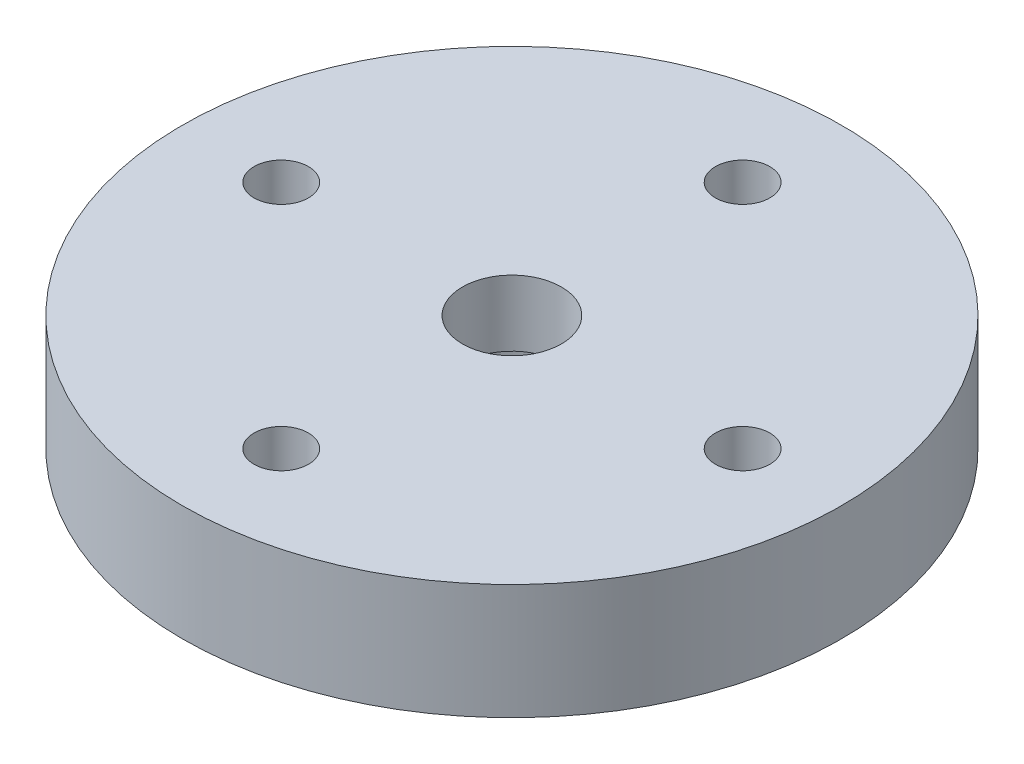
from build123d import *
from build123d.topology import SkipClean

# Parameters (mm, degrees)
SKETCH1_R           = 10
SKETCH1_R_2         = 1.5
SKETCH1_R_3         = 0.825
BOSS_EXTRUDE1_DEPTH = 3.5
BOSS_EXTRUDE2_START = 2
SKETCH2_R           = 4.5
SKETCH2_R_2         = 1.5
BOSS_EXTRUDE2_DEPTH = 2
SKETCH3_R           = 3
CUT_EXTRUDE1_DEPTH  = 3.5
CHAMFER1_SIZE       = 0.5


with BuildPart() as part:
    # Sketch1 → Boss-Extrude1 (new body)
    with BuildSketch(Plane(origin=(0, 0, 0), x_dir=(1, 0, 0), z_dir=(0, 1, 0))):
        with Locations(Location((0, 0, 0), (0, 0, 270))):
            Circle(SKETCH1_R)
        with Locations(Location((0, 0, 0), (0, 0, 270))):
            Circle(SKETCH1_R_2, mode=Mode.SUBTRACT)
        with Locations(Location((0, 7, 0), (0, 0, 270))):
            Circle(SKETCH1_R_3, mode=Mode.SUBTRACT)
        with Locations(Location((7, 0, 0), (0, 0, 270))):
            Circle(SKETCH1_R_3, mode=Mode.SUBTRACT)
        with Locations(Location((0, -7, 0), (0, 0, 270))):
            Circle(SKETCH1_R_3, mode=Mode.SUBTRACT)
        with Locations(Location((-7, 0, 0), (0, 0, 270))):
            Circle(SKETCH1_R_3, mode=Mode.SUBTRACT)
    extrude(amount=BOSS_EXTRUDE1_DEPTH)

    # Sketch2 → Boss-Extrude2 (add)
    with SkipClean():  # the faces are left unmerged after this step: merging them gives an invalid solid
        with BuildSketch(Plane.XZ.offset(BOSS_EXTRUDE2_START)):
            with Locations(Location((0, 0, 0), (0, 0, 90))):
                Circle(SKETCH2_R)
            with Locations(Location((0, 0, 0), (0, 0, 270))):
                Circle(SKETCH2_R_2, mode=Mode.SUBTRACT)
        extrude(amount=-BOSS_EXTRUDE2_DEPTH)

    # Sketch3 → Cut-Extrude1 (cut)
    with BuildSketch(Plane.XZ.offset(2)):
        with Locations(Location((0, 0, 0), (0, 0, 270))):
            Circle(SKETCH3_R)
    extrude(amount=-CUT_EXTRUDE1_DEPTH, mode=Mode.SUBTRACT)

    # Chamfer1
    chamfer1_edges = [part.edges().sort_by_distance(p)[0] for p in [
        (0, -2, 3),
    ]]
    chamfer(chamfer1_edges, length=CHAMFER1_SIZE)


solid = part.part
